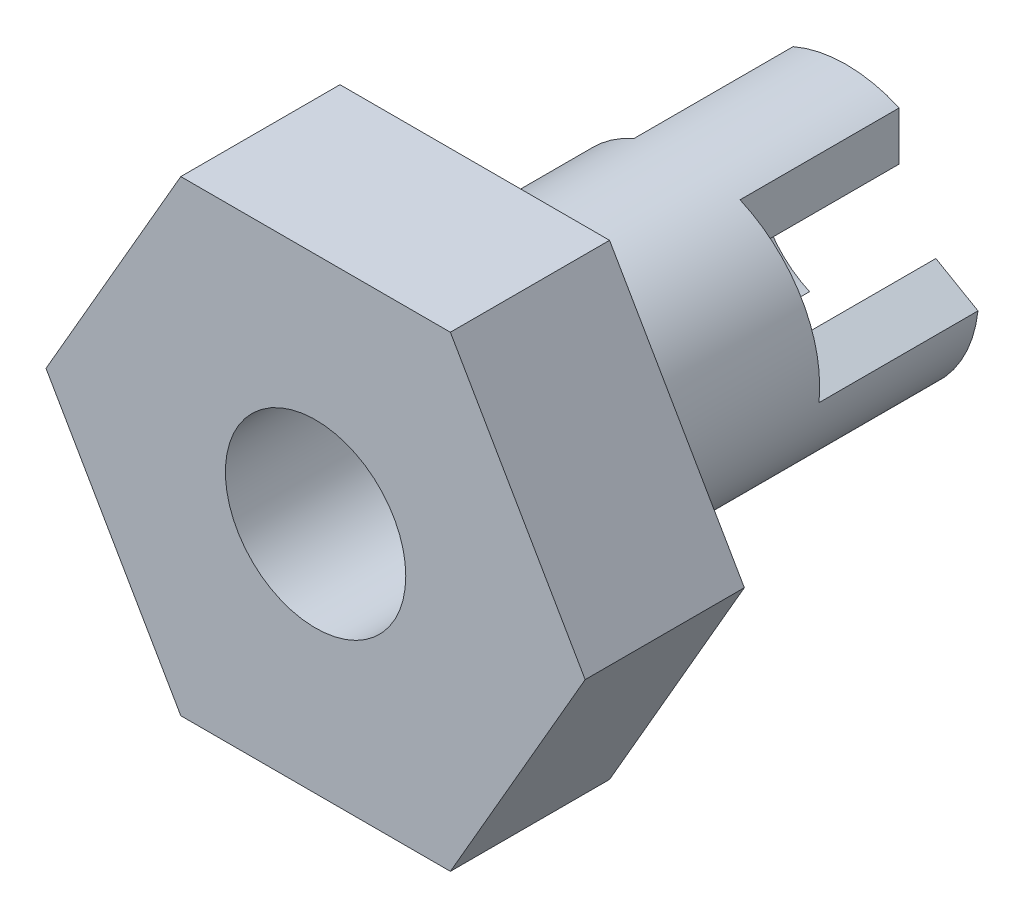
ISO-10303-21;
HEADER;
FILE_DESCRIPTION(('STEP AP214'),'2;1');
FILE_NAME('part.step','',(''),(''),'','','');
FILE_SCHEMA(('AUTOMOTIVE_DESIGN { 1 0 10303 214 1 1 1 1 }'));
ENDSEC;
DATA;
#1=APPLICATION_CONTEXT('core data for automotive mechanical design processes');
#2=APPLICATION_PROTOCOL_DEFINITION('international standard','automotive_design',2000,#1);
#3=PRODUCT_CONTEXT('',#1,'mechanical');
#4=PRODUCT('Part','Part','',(#3));
#5=PRODUCT_RELATED_PRODUCT_CATEGORY('part','',(#4));
#6=PRODUCT_DEFINITION_FORMATION('','',#4);
#7=PRODUCT_DEFINITION_CONTEXT('part definition',#1,'design');
#8=PRODUCT_DEFINITION('design','',#6,#7);
#9=PRODUCT_DEFINITION_SHAPE('','',#8);
#10=(LENGTH_UNIT() NAMED_UNIT(*) SI_UNIT(.MILLI.,.METRE.));
#11=(NAMED_UNIT(*) PLANE_ANGLE_UNIT() SI_UNIT($,.RADIAN.));
#12=(NAMED_UNIT(*) SI_UNIT($,.STERADIAN.) SOLID_ANGLE_UNIT());
#13=UNCERTAINTY_MEASURE_WITH_UNIT(LENGTH_MEASURE(1.E-05),#10,'distance_accuracy_value','');
#14=(GEOMETRIC_REPRESENTATION_CONTEXT(3) GLOBAL_UNCERTAINTY_ASSIGNED_CONTEXT((#13)) GLOBAL_UNIT_ASSIGNED_CONTEXT((#10,
#11,#12)) REPRESENTATION_CONTEXT('',''));
#15=CARTESIAN_POINT('',(0.,0.,0.));
#16=DIRECTION('',(0.,0.,1.));
#17=DIRECTION('',(1.,0.,0.));
#18=AXIS2_PLACEMENT_3D('',#15,#16,#17);
#19=CARTESIAN_POINT('',(0.,0.,-5.08));
#20=DIRECTION('',(0.,0.,-1.));
#21=DIRECTION('',(-1.,0.,0.));
#22=AXIS2_PLACEMENT_3D('',#19,#20,#21);
#23=PLANE('',#22);
#24=CARTESIAN_POINT('',(0.,0.,-5.08));
#25=DIRECTION('',(0.,0.,-1.));
#26=DIRECTION('',(-1.,0.,0.));
#27=AXIS2_PLACEMENT_3D('',#24,#25,#26);
#28=CIRCLE('',#27,3.175);
#29=CARTESIAN_POINT('',(1.27,2.90993556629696,-5.08));
#30=VERTEX_POINT('',#29);
#31=CARTESIAN_POINT('',(3.15507812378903,-0.355115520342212,-5.08));
#32=VERTEX_POINT('',#31);
#33=EDGE_CURVE('E250',#30,#32,#28,.T.);
#34=ORIENTED_EDGE('',*,*,#33,.T.);
#35=DIRECTION('',(0.86602540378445,-0.499999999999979,0.));
#36=VECTOR('',#35,1.);
#37=CARTESIAN_POINT('',(3.15507812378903,-0.355115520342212,-5.08));
#38=LINE('',#37,#36);
#39=CARTESIAN_POINT('',(2.14704687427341,0.226871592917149,-5.08));
#40=VERTEX_POINT('',#39);
#41=EDGE_CURVE('E58',#40,#32,#38,.T.);
#42=ORIENTED_EDGE('',*,*,#41,.F.);
#43=CARTESIAN_POINT('',(0.,0.,-5.08));
#44=DIRECTION('',(0.,0.,-1.));
#45=DIRECTION('',(-1.,0.,0.));
#46=AXIS2_PLACEMENT_3D('',#43,#44,#45);
#47=CIRCLE('',#46,2.159);
#48=CARTESIAN_POINT('',(1.27,1.74596133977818,-5.08));
#49=VERTEX_POINT('',#48);
#50=EDGE_CURVE('E185',#49,#40,#47,.T.);
#51=ORIENTED_EDGE('',*,*,#50,.F.);
#52=DIRECTION('',(0.,-1.,0.));
#53=VECTOR('',#52,1.);
#54=CARTESIAN_POINT('',(1.27,2.90993556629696,-5.08));
#55=LINE('',#54,#53);
#56=EDGE_CURVE('E189',#30,#49,#55,.T.);
#57=ORIENTED_EDGE('',*,*,#56,.F.);
#58=EDGE_LOOP('',(#34,#42,#51,#57));
#59=FACE_BOUND('',#58,.T.);
#60=ADVANCED_FACE('F35',(#59),#23,.T.);
#61=CARTESIAN_POINT('',(0.877046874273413,-1.97283293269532,-5.08));
#62=VERTEX_POINT('',#61);
#63=CARTESIAN_POINT('',(-0.877046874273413,-1.97283293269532,-5.08));
#64=VERTEX_POINT('',#63);
#65=EDGE_CURVE('E50',#62,#64,#47,.T.);
#66=ORIENTED_EDGE('',*,*,#65,.F.);
#67=DIRECTION('',(-0.866025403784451,0.499999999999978,0.));
#68=VECTOR('',#67,1.);
#69=CARTESIAN_POINT('',(1.88507812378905,-2.5548200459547,-5.08));
#70=LINE('',#69,#68);
#71=CARTESIAN_POINT('',(1.88507812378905,-2.5548200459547,-5.08));
#72=VERTEX_POINT('',#71);
#73=EDGE_CURVE('E180',#72,#62,#70,.T.);
#74=ORIENTED_EDGE('',*,*,#73,.F.);
#75=CARTESIAN_POINT('',(-1.88507812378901,-2.55482004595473,-5.08));
#76=VERTEX_POINT('',#75);
#77=EDGE_CURVE('E246',#72,#76,#28,.T.);
#78=ORIENTED_EDGE('',*,*,#77,.T.);
#79=DIRECTION('',(-0.866025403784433,-0.50000000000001,0.));
#80=VECTOR('',#79,1.);
#81=CARTESIAN_POINT('',(-1.88507812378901,-2.55482004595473,-5.08));
#82=LINE('',#81,#80);
#83=EDGE_CURVE('E217',#64,#76,#82,.T.);
#84=ORIENTED_EDGE('',*,*,#83,.F.);
#85=EDGE_LOOP('',(#66,#74,#78,#84));
#86=FACE_BOUND('',#85,.T.);
#87=ADVANCED_FACE('F335',(#86),#23,.T.);
#88=CARTESIAN_POINT('',(-3.15507812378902,-0.355115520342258,-5.08));
#89=VERTEX_POINT('',#88);
#90=CARTESIAN_POINT('',(-1.27,2.90993556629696,-5.08));
#91=VERTEX_POINT('',#90);
#92=EDGE_CURVE('E247',#89,#91,#28,.T.);
#93=ORIENTED_EDGE('',*,*,#92,.T.);
#94=DIRECTION('',(0.,1.,0.));
#95=VECTOR('',#94,1.);
#96=CARTESIAN_POINT('',(-1.27,2.90993556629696,-5.08));
#97=LINE('',#96,#95);
#98=CARTESIAN_POINT('',(-1.27,1.74596133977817,-5.08));
#99=VERTEX_POINT('',#98);
#100=EDGE_CURVE('E186',#99,#91,#97,.T.);
#101=ORIENTED_EDGE('',*,*,#100,.F.);
#102=CARTESIAN_POINT('',(-2.14704687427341,0.22687159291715,-5.08));
#103=VERTEX_POINT('',#102);
#104=EDGE_CURVE('E244',#103,#99,#47,.T.);
#105=ORIENTED_EDGE('',*,*,#104,.F.);
#106=DIRECTION('',(0.866025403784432,0.500000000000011,0.));
#107=VECTOR('',#106,1.);
#108=CARTESIAN_POINT('',(-3.15507812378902,-0.355115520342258,-5.08));
#109=LINE('',#108,#107);
#110=EDGE_CURVE('E222',#89,#103,#109,.T.);
#111=ORIENTED_EDGE('',*,*,#110,.F.);
#112=EDGE_LOOP('',(#93,#101,#105,#111));
#113=FACE_BOUND('',#112,.T.);
#114=ADVANCED_FACE('F337',(#113),#23,.T.);
#115=CARTESIAN_POINT('',(0.,0.,0.));
#116=DIRECTION('',(0.,0.,1.));
#117=DIRECTION('',(1.,0.,0.));
#118=AXIS2_PLACEMENT_3D('',#115,#116,#117);
#119=PLANE('',#118);
#120=DIRECTION('',(0.499999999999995,0.866025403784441,0.));
#121=VECTOR('',#120,1.);
#122=CARTESIAN_POINT('',(3.2262333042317,-5.58799999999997,0.));
#123=LINE('',#122,#121);
#124=CARTESIAN_POINT('',(3.2262333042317,-5.58799999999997,0.));
#125=VERTEX_POINT('',#124);
#126=CARTESIAN_POINT('',(6.45246660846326,0.,0.));
#127=VERTEX_POINT('',#126);
#128=EDGE_CURVE('E253',#125,#127,#123,.T.);
#129=ORIENTED_EDGE('',*,*,#128,.F.);
#130=DIRECTION('',(1.,0.,0.));
#131=VECTOR('',#130,1.);
#132=CARTESIAN_POINT('',(-3.22623330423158,-5.58800000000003,0.));
#133=LINE('',#132,#131);
#134=CARTESIAN_POINT('',(-3.22623330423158,-5.58800000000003,0.));
#135=VERTEX_POINT('',#134);
#136=EDGE_CURVE('E258',#135,#125,#133,.T.);
#137=ORIENTED_EDGE('',*,*,#136,.F.);
#138=DIRECTION('',(0.500000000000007,-0.866025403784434,0.));
#139=VECTOR('',#138,1.);
#140=CARTESIAN_POINT('',(-6.45246660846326,0.,0.));
#141=LINE('',#140,#139);
#142=CARTESIAN_POINT('',(-6.45246660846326,0.,0.));
#143=VERTEX_POINT('',#142);
#144=EDGE_CURVE('E277',#143,#135,#141,.T.);
#145=ORIENTED_EDGE('',*,*,#144,.F.);
#146=DIRECTION('',(-0.499999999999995,-0.866025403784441,0.));
#147=VECTOR('',#146,1.);
#148=CARTESIAN_POINT('',(-3.22623330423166,5.58799999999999,0.));
#149=LINE('',#148,#147);
#150=CARTESIAN_POINT('',(-3.22623330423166,5.58799999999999,0.));
#151=VERTEX_POINT('',#150);
#152=EDGE_CURVE('E275',#151,#143,#149,.T.);
#153=ORIENTED_EDGE('',*,*,#152,.F.);
#154=DIRECTION('',(-1.,0.,0.));
#155=VECTOR('',#154,1.);
#156=CARTESIAN_POINT('',(3.22623330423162,5.58800000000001,0.));
#157=LINE('',#156,#155);
#158=CARTESIAN_POINT('',(3.22623330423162,5.58800000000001,0.));
#159=VERTEX_POINT('',#158);
#160=EDGE_CURVE('E273',#159,#151,#157,.T.);
#161=ORIENTED_EDGE('',*,*,#160,.F.);
#162=DIRECTION('',(-0.500000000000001,0.866025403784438,0.));
#163=VECTOR('',#162,1.);
#164=CARTESIAN_POINT('',(6.45246660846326,0.,0.));
#165=LINE('',#164,#163);
#166=EDGE_CURVE('E271',#127,#159,#165,.T.);
#167=ORIENTED_EDGE('',*,*,#166,.F.);
#168=EDGE_LOOP('',(#129,#137,#145,#153,#161,#167));
#169=FACE_BOUND('',#168,.T.);
#170=CARTESIAN_POINT('',(0.,0.,0.));
#171=DIRECTION('',(0.,0.,1.));
#172=DIRECTION('',(1.,0.,0.));
#173=AXIS2_PLACEMENT_3D('',#170,#171,#172);
#174=CIRCLE('',#173,3.175);
#175=CARTESIAN_POINT('',(3.175,0.,0.));
#176=VERTEX_POINT('',#175);
#177=EDGE_CURVE('E11',#176,#176,#174,.F.);
#178=ORIENTED_EDGE('',*,*,#177,.F.);
#179=EDGE_LOOP('',(#178));
#180=FACE_BOUND('',#179,.T.);
#181=ADVANCED_FACE('F304',(#169,#180),#119,.F.);
#182=CARTESIAN_POINT('',(3.2262333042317,-5.58799999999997,3.81));
#183=DIRECTION('',(-0.866025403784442,0.499999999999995,0.));
#184=DIRECTION('',(-0.499999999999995,-0.866025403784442,0.));
#185=AXIS2_PLACEMENT_3D('',#182,#183,#184);
#186=PLANE('',#185);
#187=ORIENTED_EDGE('',*,*,#128,.T.);
#188=DIRECTION('',(0.,0.,-1.));
#189=VECTOR('',#188,1.);
#190=CARTESIAN_POINT('',(6.45246660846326,0.,3.81));
#191=LINE('',#190,#189);
#192=CARTESIAN_POINT('',(6.45246660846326,0.,3.81));
#193=VERTEX_POINT('',#192);
#194=EDGE_CURVE('E43',#193,#127,#191,.T.);
#195=ORIENTED_EDGE('',*,*,#194,.F.);
#196=DIRECTION('',(0.499999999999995,0.866025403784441,0.));
#197=VECTOR('',#196,1.);
#198=CARTESIAN_POINT('',(3.2262333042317,-5.58799999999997,3.81));
#199=LINE('',#198,#197);
#200=CARTESIAN_POINT('',(3.2262333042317,-5.58799999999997,3.81));
#201=VERTEX_POINT('',#200);
#202=EDGE_CURVE('E254',#201,#193,#199,.T.);
#203=ORIENTED_EDGE('',*,*,#202,.F.);
#204=DIRECTION('',(0.,0.,-1.));
#205=VECTOR('',#204,1.);
#206=CARTESIAN_POINT('',(3.2262333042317,-5.58799999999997,3.81));
#207=LINE('',#206,#205);
#208=EDGE_CURVE('E268',#201,#125,#207,.T.);
#209=ORIENTED_EDGE('',*,*,#208,.T.);
#210=EDGE_LOOP('',(#187,#195,#203,#209));
#211=FACE_BOUND('',#210,.T.);
#212=ADVANCED_FACE('F37',(#211),#186,.F.);
#213=CARTESIAN_POINT('',(6.45246660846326,0.,3.81));
#214=DIRECTION('',(-0.866025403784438,-0.500000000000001,0.));
#215=DIRECTION('',(0.500000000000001,-0.866025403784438,0.));
#216=AXIS2_PLACEMENT_3D('',#213,#214,#215);
#217=PLANE('',#216);
#218=ORIENTED_EDGE('',*,*,#166,.T.);
#219=DIRECTION('',(0.,0.,-1.));
#220=VECTOR('',#219,1.);
#221=CARTESIAN_POINT('',(3.22623330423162,5.58800000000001,3.81));
#222=LINE('',#221,#220);
#223=CARTESIAN_POINT('',(3.22623330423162,5.58800000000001,3.81));
#224=VERTEX_POINT('',#223);
#225=EDGE_CURVE('E291',#224,#159,#222,.T.);
#226=ORIENTED_EDGE('',*,*,#225,.F.);
#227=DIRECTION('',(-0.500000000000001,0.866025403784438,0.));
#228=VECTOR('',#227,1.);
#229=CARTESIAN_POINT('',(6.45246660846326,0.,3.81));
#230=LINE('',#229,#228);
#231=EDGE_CURVE('E257',#193,#224,#230,.T.);
#232=ORIENTED_EDGE('',*,*,#231,.F.);
#233=ORIENTED_EDGE('',*,*,#194,.T.);
#234=EDGE_LOOP('',(#218,#226,#232,#233));
#235=FACE_BOUND('',#234,.T.);
#236=ADVANCED_FACE('F296',(#235),#217,.F.);
#237=CARTESIAN_POINT('',(3.22623330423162,5.58800000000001,3.81));
#238=DIRECTION('',(0.,-1.,0.));
#239=DIRECTION('',(1.,0.,0.));
#240=AXIS2_PLACEMENT_3D('',#237,#238,#239);
#241=PLANE('',#240);
#242=ORIENTED_EDGE('',*,*,#160,.T.);
#243=DIRECTION('',(0.,0.,-1.));
#244=VECTOR('',#243,1.);
#245=CARTESIAN_POINT('',(-3.22623330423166,5.58799999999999,3.81));
#246=LINE('',#245,#244);
#247=CARTESIAN_POINT('',(-3.22623330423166,5.58799999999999,3.81));
#248=VERTEX_POINT('',#247);
#249=EDGE_CURVE('E288',#248,#151,#246,.T.);
#250=ORIENTED_EDGE('',*,*,#249,.F.);
#251=DIRECTION('',(-1.,0.,0.));
#252=VECTOR('',#251,1.);
#253=CARTESIAN_POINT('',(3.22623330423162,5.58800000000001,3.81));
#254=LINE('',#253,#252);
#255=EDGE_CURVE('E260',#224,#248,#254,.T.);
#256=ORIENTED_EDGE('',*,*,#255,.F.);
#257=ORIENTED_EDGE('',*,*,#225,.T.);
#258=EDGE_LOOP('',(#242,#250,#256,#257));
#259=FACE_BOUND('',#258,.T.);
#260=ADVANCED_FACE('F311',(#259),#241,.F.);
#261=CARTESIAN_POINT('',(-3.22623330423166,5.58799999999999,3.81));
#262=DIRECTION('',(0.866025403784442,-0.499999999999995,0.));
#263=DIRECTION('',(0.499999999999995,0.866025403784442,0.));
#264=AXIS2_PLACEMENT_3D('',#261,#262,#263);
#265=PLANE('',#264);
#266=ORIENTED_EDGE('',*,*,#152,.T.);
#267=DIRECTION('',(0.,0.,-1.));
#268=VECTOR('',#267,1.);
#269=CARTESIAN_POINT('',(-6.45246660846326,0.,3.81));
#270=LINE('',#269,#268);
#271=CARTESIAN_POINT('',(-6.45246660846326,0.,3.81));
#272=VERTEX_POINT('',#271);
#273=EDGE_CURVE('E285',#272,#143,#270,.T.);
#274=ORIENTED_EDGE('',*,*,#273,.F.);
#275=DIRECTION('',(-0.499999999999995,-0.866025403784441,0.));
#276=VECTOR('',#275,1.);
#277=CARTESIAN_POINT('',(-3.22623330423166,5.58799999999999,3.81));
#278=LINE('',#277,#276);
#279=EDGE_CURVE('E262',#248,#272,#278,.T.);
#280=ORIENTED_EDGE('',*,*,#279,.F.);
#281=ORIENTED_EDGE('',*,*,#249,.T.);
#282=EDGE_LOOP('',(#266,#274,#280,#281));
#283=FACE_BOUND('',#282,.T.);
#284=ADVANCED_FACE('F315',(#283),#265,.F.);
#285=CARTESIAN_POINT('',(-6.45246660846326,0.,3.81));
#286=DIRECTION('',(0.866025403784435,0.500000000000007,0.));
#287=DIRECTION('',(-0.500000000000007,0.866025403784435,0.));
#288=AXIS2_PLACEMENT_3D('',#285,#286,#287);
#289=PLANE('',#288);
#290=ORIENTED_EDGE('',*,*,#144,.T.);
#291=DIRECTION('',(0.,0.,-1.));
#292=VECTOR('',#291,1.);
#293=CARTESIAN_POINT('',(-3.22623330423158,-5.58800000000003,3.81));
#294=LINE('',#293,#292);
#295=CARTESIAN_POINT('',(-3.22623330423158,-5.58800000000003,3.81));
#296=VERTEX_POINT('',#295);
#297=EDGE_CURVE('E282',#296,#135,#294,.T.);
#298=ORIENTED_EDGE('',*,*,#297,.F.);
#299=DIRECTION('',(0.500000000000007,-0.866025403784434,0.));
#300=VECTOR('',#299,1.);
#301=CARTESIAN_POINT('',(-6.45246660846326,0.,3.81));
#302=LINE('',#301,#300);
#303=EDGE_CURVE('E264',#272,#296,#302,.T.);
#304=ORIENTED_EDGE('',*,*,#303,.F.);
#305=ORIENTED_EDGE('',*,*,#273,.T.);
#306=EDGE_LOOP('',(#290,#298,#304,#305));
#307=FACE_BOUND('',#306,.T.);
#308=ADVANCED_FACE('F325',(#307),#289,.F.);
#309=CARTESIAN_POINT('',(-3.22623330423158,-5.58800000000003,3.81));
#310=DIRECTION('',(0.,1.,0.));
#311=DIRECTION('',(-1.,0.,0.));
#312=AXIS2_PLACEMENT_3D('',#309,#310,#311);
#313=PLANE('',#312);
#314=ORIENTED_EDGE('',*,*,#136,.T.);
#315=ORIENTED_EDGE('',*,*,#208,.F.);
#316=DIRECTION('',(1.,0.,0.));
#317=VECTOR('',#316,1.);
#318=CARTESIAN_POINT('',(-3.22623330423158,-5.58800000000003,3.81));
#319=LINE('',#318,#317);
#320=EDGE_CURVE('E266',#296,#201,#319,.T.);
#321=ORIENTED_EDGE('',*,*,#320,.F.);
#322=ORIENTED_EDGE('',*,*,#297,.T.);
#323=EDGE_LOOP('',(#314,#315,#321,#322));
#324=FACE_BOUND('',#323,.T.);
#325=ADVANCED_FACE('F323',(#324),#313,.F.);
#326=CARTESIAN_POINT('',(0.,0.,3.81));
#327=DIRECTION('',(0.,0.,1.));
#328=DIRECTION('',(1.,0.,0.));
#329=AXIS2_PLACEMENT_3D('',#326,#327,#328);
#330=PLANE('',#329);
#331=CARTESIAN_POINT('',(0.,0.,3.81));
#332=DIRECTION('',(0.,0.,1.));
#333=DIRECTION('',(1.,0.,0.));
#334=AXIS2_PLACEMENT_3D('',#331,#332,#333);
#335=CIRCLE('',#334,2.159);
#336=CARTESIAN_POINT('',(2.159,0.,3.81));
#337=VERTEX_POINT('',#336);
#338=EDGE_CURVE('E249',#337,#337,#335,.T.);
#339=ORIENTED_EDGE('',*,*,#338,.F.);
#340=EDGE_LOOP('',(#339));
#341=FACE_BOUND('',#340,.T.);
#342=ORIENTED_EDGE('',*,*,#202,.T.);
#343=ORIENTED_EDGE('',*,*,#231,.T.);
#344=ORIENTED_EDGE('',*,*,#255,.T.);
#345=ORIENTED_EDGE('',*,*,#279,.T.);
#346=ORIENTED_EDGE('',*,*,#303,.T.);
#347=ORIENTED_EDGE('',*,*,#320,.T.);
#348=EDGE_LOOP('',(#342,#343,#344,#345,#346,#347));
#349=FACE_BOUND('',#348,.T.);
#350=ADVANCED_FACE('F319',(#341,#349),#330,.T.);
#351=CARTESIAN_POINT('',(0.,0.,0.));
#352=DIRECTION('',(0.,0.,1.));
#353=DIRECTION('',(1.,0.,0.));
#354=AXIS2_PLACEMENT_3D('',#351,#352,#353);
#355=CYLINDRICAL_SURFACE('',#354,2.159);
#356=ORIENTED_EDGE('',*,*,#338,.T.);
#357=EDGE_LOOP('',(#356));
#358=FACE_BOUND('',#357,.T.);
#359=ORIENTED_EDGE('',*,*,#104,.T.);
#360=DIRECTION('',(0.,0.,1.));
#361=VECTOR('',#360,1.);
#362=CARTESIAN_POINT('',(-1.27,1.74596133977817,-8.89));
#363=LINE('',#362,#361);
#364=CARTESIAN_POINT('',(-1.27,1.74596133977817,-8.89));
#365=VERTEX_POINT('',#364);
#366=EDGE_CURVE('E214',#365,#99,#363,.T.);
#367=ORIENTED_EDGE('',*,*,#366,.F.);
#368=CARTESIAN_POINT('',(0.,0.,-8.89));
#369=DIRECTION('',(0.,0.,1.));
#370=DIRECTION('',(-1.,0.,0.));
#371=AXIS2_PLACEMENT_3D('',#368,#369,#370);
#372=CIRCLE('',#371,2.159);
#373=CARTESIAN_POINT('',(1.27,1.74596133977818,-8.89));
#374=VERTEX_POINT('',#373);
#375=EDGE_CURVE('E195',#374,#365,#372,.T.);
#376=ORIENTED_EDGE('',*,*,#375,.F.);
#377=DIRECTION('',(0.,0.,1.));
#378=VECTOR('',#377,1.);
#379=CARTESIAN_POINT('',(1.27,1.74596133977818,-8.89));
#380=LINE('',#379,#378);
#381=EDGE_CURVE('E203',#374,#49,#380,.T.);
#382=ORIENTED_EDGE('',*,*,#381,.T.);
#383=ORIENTED_EDGE('',*,*,#50,.T.);
#384=DIRECTION('',(0.,0.,1.));
#385=VECTOR('',#384,1.);
#386=CARTESIAN_POINT('',(2.14704687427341,0.226871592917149,-8.89));
#387=LINE('',#386,#385);
#388=CARTESIAN_POINT('',(2.14704687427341,0.226871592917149,-8.89));
#389=VERTEX_POINT('',#388);
#390=EDGE_CURVE('E165',#389,#40,#387,.T.);
#391=ORIENTED_EDGE('',*,*,#390,.F.);
#392=CARTESIAN_POINT('',(0.,0.,-8.89));
#393=DIRECTION('',(0.,0.,1.));
#394=DIRECTION('',(-1.,0.,0.));
#395=AXIS2_PLACEMENT_3D('',#392,#393,#394);
#396=CIRCLE('',#395,2.159);
#397=CARTESIAN_POINT('',(0.877046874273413,-1.97283293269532,-8.89));
#398=VERTEX_POINT('',#397);
#399=EDGE_CURVE('E171',#398,#389,#396,.T.);
#400=ORIENTED_EDGE('',*,*,#399,.F.);
#401=DIRECTION('',(0.,0.,1.));
#402=VECTOR('',#401,1.);
#403=CARTESIAN_POINT('',(0.877046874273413,-1.97283293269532,-8.89));
#404=LINE('',#403,#402);
#405=EDGE_CURVE('E382',#398,#62,#404,.T.);
#406=ORIENTED_EDGE('',*,*,#405,.T.);
#407=ORIENTED_EDGE('',*,*,#65,.T.);
#408=DIRECTION('',(0.,0.,1.));
#409=VECTOR('',#408,1.);
#410=CARTESIAN_POINT('',(-0.877046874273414,-1.97283293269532,-8.89));
#411=LINE('',#410,#409);
#412=CARTESIAN_POINT('',(-0.877046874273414,-1.97283293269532,-8.89));
#413=VERTEX_POINT('',#412);
#414=EDGE_CURVE('E241',#413,#64,#411,.T.);
#415=ORIENTED_EDGE('',*,*,#414,.F.);
#416=CARTESIAN_POINT('',(0.,0.,-8.89));
#417=DIRECTION('',(0.,0.,1.));
#418=DIRECTION('',(-1.,0.,0.));
#419=AXIS2_PLACEMENT_3D('',#416,#417,#418);
#420=CIRCLE('',#419,2.159);
#421=CARTESIAN_POINT('',(-2.14704687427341,0.22687159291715,-8.89));
#422=VERTEX_POINT('',#421);
#423=EDGE_CURVE('E218',#422,#413,#420,.T.);
#424=ORIENTED_EDGE('',*,*,#423,.F.);
#425=DIRECTION('',(0.,0.,1.));
#426=VECTOR('',#425,1.);
#427=CARTESIAN_POINT('',(-2.14704687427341,0.22687159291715,-8.89));
#428=LINE('',#427,#426);
#429=EDGE_CURVE('E228',#422,#103,#428,.T.);
#430=ORIENTED_EDGE('',*,*,#429,.T.);
#431=EDGE_LOOP('',(#359,#367,#376,#382,#383,#391,#400,#406,#407,#415,#424,#430));
#432=FACE_BOUND('',#431,.T.);
#433=ADVANCED_FACE('F183',(#358,#432),#355,.F.);
#434=CARTESIAN_POINT('',(0.,0.,-5.08));
#435=DIRECTION('',(0.,0.,1.));
#436=DIRECTION('',(1.,0.,0.));
#437=AXIS2_PLACEMENT_3D('',#434,#435,#436);
#438=CYLINDRICAL_SURFACE('',#437,3.175);
#439=ORIENTED_EDGE('',*,*,#92,.F.);
#440=DIRECTION('',(0.,0.,1.));
#441=VECTOR('',#440,1.);
#442=CARTESIAN_POINT('',(-3.15507812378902,-0.355115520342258,-8.89));
#443=LINE('',#442,#441);
#444=CARTESIAN_POINT('',(-3.15507812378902,-0.355115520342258,-8.89));
#445=VERTEX_POINT('',#444);
#446=EDGE_CURVE('E235',#445,#89,#443,.T.);
#447=ORIENTED_EDGE('',*,*,#446,.F.);
#448=CARTESIAN_POINT('',(0.,0.,-8.89));
#449=DIRECTION('',(0.,0.,-1.));
#450=DIRECTION('',(-1.,0.,0.));
#451=AXIS2_PLACEMENT_3D('',#448,#449,#450);
#452=CIRCLE('',#451,3.175);
#453=CARTESIAN_POINT('',(-1.88507812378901,-2.55482004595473,-8.89));
#454=VERTEX_POINT('',#453);
#455=EDGE_CURVE('E224',#454,#445,#452,.T.);
#456=ORIENTED_EDGE('',*,*,#455,.F.);
#457=DIRECTION('',(0.,0.,1.));
#458=VECTOR('',#457,1.);
#459=CARTESIAN_POINT('',(-1.88507812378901,-2.55482004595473,-8.89));
#460=LINE('',#459,#458);
#461=EDGE_CURVE('E238',#454,#76,#460,.T.);
#462=ORIENTED_EDGE('',*,*,#461,.T.);
#463=ORIENTED_EDGE('',*,*,#77,.F.);
#464=DIRECTION('',(0.,0.,1.));
#465=VECTOR('',#464,1.);
#466=CARTESIAN_POINT('',(1.88507812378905,-2.5548200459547,-8.89));
#467=LINE('',#466,#465);
#468=CARTESIAN_POINT('',(1.88507812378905,-2.5548200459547,-8.89));
#469=VERTEX_POINT('',#468);
#470=EDGE_CURVE('E191',#469,#72,#467,.T.);
#471=ORIENTED_EDGE('',*,*,#470,.F.);
#472=CARTESIAN_POINT('',(0.,0.,-8.89));
#473=DIRECTION('',(0.,0.,-1.));
#474=DIRECTION('',(-1.,0.,0.));
#475=AXIS2_PLACEMENT_3D('',#472,#473,#474);
#476=CIRCLE('',#475,3.175);
#477=CARTESIAN_POINT('',(3.15507812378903,-0.355115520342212,-8.89));
#478=VERTEX_POINT('',#477);
#479=EDGE_CURVE('E170',#478,#469,#476,.T.);
#480=ORIENTED_EDGE('',*,*,#479,.F.);
#481=DIRECTION('',(0.,0.,1.));
#482=VECTOR('',#481,1.);
#483=CARTESIAN_POINT('',(3.15507812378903,-0.355115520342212,-8.89));
#484=LINE('',#483,#482);
#485=EDGE_CURVE('E167',#478,#32,#484,.T.);
#486=ORIENTED_EDGE('',*,*,#485,.T.);
#487=ORIENTED_EDGE('',*,*,#33,.F.);
#488=DIRECTION('',(0.,0.,1.));
#489=VECTOR('',#488,1.);
#490=CARTESIAN_POINT('',(1.27,2.90993556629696,-8.89));
#491=LINE('',#490,#489);
#492=CARTESIAN_POINT('',(1.27,2.90993556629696,-8.89));
#493=VERTEX_POINT('',#492);
#494=EDGE_CURVE('E208',#493,#30,#491,.T.);
#495=ORIENTED_EDGE('',*,*,#494,.F.);
#496=CARTESIAN_POINT('',(0.,0.,-8.89));
#497=DIRECTION('',(0.,0.,-1.));
#498=DIRECTION('',(-1.,0.,0.));
#499=AXIS2_PLACEMENT_3D('',#496,#497,#498);
#500=CIRCLE('',#499,3.175);
#501=CARTESIAN_POINT('',(-1.27,2.90993556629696,-8.89));
#502=VERTEX_POINT('',#501);
#503=EDGE_CURVE('E200',#502,#493,#500,.T.);
#504=ORIENTED_EDGE('',*,*,#503,.F.);
#505=DIRECTION('',(0.,0.,1.));
#506=VECTOR('',#505,1.);
#507=CARTESIAN_POINT('',(-1.27,2.90993556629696,-8.89));
#508=LINE('',#507,#506);
#509=EDGE_CURVE('E211',#502,#91,#508,.T.);
#510=ORIENTED_EDGE('',*,*,#509,.T.);
#511=EDGE_LOOP('',(#439,#447,#456,#462,#463,#471,#480,#486,#487,#495,#504,#510));
#512=FACE_BOUND('',#511,.T.);
#513=ORIENTED_EDGE('',*,*,#177,.T.);
#514=EDGE_LOOP('',(#513));
#515=FACE_BOUND('',#514,.T.);
#516=ADVANCED_FACE('F357',(#512,#515),#438,.T.);
#517=CARTESIAN_POINT('',(-1.88507812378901,-2.55482004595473,-8.89));
#518=DIRECTION('',(-0.50000000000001,0.866025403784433,0.));
#519=DIRECTION('',(-0.866025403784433,-0.50000000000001,0.));
#520=AXIS2_PLACEMENT_3D('',#517,#518,#519);
#521=PLANE('',#520);
#522=ORIENTED_EDGE('',*,*,#83,.T.);
#523=ORIENTED_EDGE('',*,*,#461,.F.);
#524=DIRECTION('',(-0.866025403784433,-0.50000000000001,0.));
#525=VECTOR('',#524,1.);
#526=CARTESIAN_POINT('',(-1.88507812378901,-2.55482004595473,-8.89));
#527=LINE('',#526,#525);
#528=EDGE_CURVE('E221',#413,#454,#527,.T.);
#529=ORIENTED_EDGE('',*,*,#528,.F.);
#530=ORIENTED_EDGE('',*,*,#414,.T.);
#531=EDGE_LOOP('',(#522,#523,#529,#530));
#532=FACE_BOUND('',#531,.T.);
#533=ADVANCED_FACE('F376',(#532),#521,.F.);
#534=CARTESIAN_POINT('',(-3.15507812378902,-0.355115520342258,-8.89));
#535=DIRECTION('',(0.500000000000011,-0.866025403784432,0.));
#536=DIRECTION('',(0.866025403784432,0.500000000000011,0.));
#537=AXIS2_PLACEMENT_3D('',#534,#535,#536);
#538=PLANE('',#537);
#539=ORIENTED_EDGE('',*,*,#110,.T.);
#540=ORIENTED_EDGE('',*,*,#429,.F.);
#541=DIRECTION('',(0.866025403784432,0.500000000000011,0.));
#542=VECTOR('',#541,1.);
#543=CARTESIAN_POINT('',(-3.15507812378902,-0.355115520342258,-8.89));
#544=LINE('',#543,#542);
#545=EDGE_CURVE('E226',#445,#422,#544,.T.);
#546=ORIENTED_EDGE('',*,*,#545,.F.);
#547=ORIENTED_EDGE('',*,*,#446,.T.);
#548=EDGE_LOOP('',(#539,#540,#546,#547));
#549=FACE_BOUND('',#548,.T.);
#550=ADVANCED_FACE('F368',(#549),#538,.F.);
#551=CARTESIAN_POINT('',(0.,0.,-8.89));
#552=DIRECTION('',(0.,0.,-1.));
#553=DIRECTION('',(-1.,0.,0.));
#554=AXIS2_PLACEMENT_3D('',#551,#552,#553);
#555=PLANE('',#554);
#556=ORIENTED_EDGE('',*,*,#423,.T.);
#557=ORIENTED_EDGE('',*,*,#528,.T.);
#558=ORIENTED_EDGE('',*,*,#455,.T.);
#559=ORIENTED_EDGE('',*,*,#545,.T.);
#560=EDGE_LOOP('',(#556,#557,#558,#559));
#561=FACE_BOUND('',#560,.T.);
#562=ADVANCED_FACE('F373',(#561),#555,.T.);
#563=CARTESIAN_POINT('',(-1.27,2.90993556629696,-8.89));
#564=DIRECTION('',(1.,0.,0.));
#565=DIRECTION('',(0.,0.,-1.));
#566=AXIS2_PLACEMENT_3D('',#563,#564,#565);
#567=PLANE('',#566);
#568=ORIENTED_EDGE('',*,*,#100,.T.);
#569=ORIENTED_EDGE('',*,*,#509,.F.);
#570=DIRECTION('',(0.,1.,0.));
#571=VECTOR('',#570,1.);
#572=CARTESIAN_POINT('',(-1.27,2.90993556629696,-8.89));
#573=LINE('',#572,#571);
#574=EDGE_CURVE('E198',#365,#502,#573,.T.);
#575=ORIENTED_EDGE('',*,*,#574,.F.);
#576=ORIENTED_EDGE('',*,*,#366,.T.);
#577=EDGE_LOOP('',(#568,#569,#575,#576));
#578=FACE_BOUND('',#577,.T.);
#579=ADVANCED_FACE('F354',(#578),#567,.F.);
#580=CARTESIAN_POINT('',(1.27,2.90993556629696,-8.89));
#581=DIRECTION('',(-1.,0.,0.));
#582=DIRECTION('',(0.,-1.,0.));
#583=AXIS2_PLACEMENT_3D('',#580,#581,#582);
#584=PLANE('',#583);
#585=ORIENTED_EDGE('',*,*,#56,.T.);
#586=ORIENTED_EDGE('',*,*,#381,.F.);
#587=DIRECTION('',(0.,-1.,0.));
#588=VECTOR('',#587,1.);
#589=CARTESIAN_POINT('',(1.27,2.90993556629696,-8.89));
#590=LINE('',#589,#588);
#591=EDGE_CURVE('E202',#493,#374,#590,.T.);
#592=ORIENTED_EDGE('',*,*,#591,.F.);
#593=ORIENTED_EDGE('',*,*,#494,.T.);
#594=EDGE_LOOP('',(#585,#586,#592,#593));
#595=FACE_BOUND('',#594,.T.);
#596=ADVANCED_FACE('F399',(#595),#584,.F.);
#597=CARTESIAN_POINT('',(0.,0.,-8.89));
#598=DIRECTION('',(0.,0.,-1.));
#599=DIRECTION('',(-1.,0.,0.));
#600=AXIS2_PLACEMENT_3D('',#597,#598,#599);
#601=PLANE('',#600);
#602=ORIENTED_EDGE('',*,*,#375,.T.);
#603=ORIENTED_EDGE('',*,*,#574,.T.);
#604=ORIENTED_EDGE('',*,*,#503,.T.);
#605=ORIENTED_EDGE('',*,*,#591,.T.);
#606=EDGE_LOOP('',(#602,#603,#604,#605));
#607=FACE_BOUND('',#606,.T.);
#608=ADVANCED_FACE('F362',(#607),#601,.T.);
#609=CARTESIAN_POINT('',(3.15507812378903,-0.355115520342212,-8.89));
#610=DIRECTION('',(-0.499999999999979,-0.86602540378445,0.));
#611=DIRECTION('',(0.866025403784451,-0.49999999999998,0.));
#612=AXIS2_PLACEMENT_3D('',#609,#610,#611);
#613=PLANE('',#612);
#614=ORIENTED_EDGE('',*,*,#41,.T.);
#615=ORIENTED_EDGE('',*,*,#485,.F.);
#616=DIRECTION('',(0.86602540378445,-0.499999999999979,0.));
#617=VECTOR('',#616,1.);
#618=CARTESIAN_POINT('',(3.15507812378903,-0.355115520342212,-8.89));
#619=LINE('',#618,#617);
#620=EDGE_CURVE('E161',#389,#478,#619,.T.);
#621=ORIENTED_EDGE('',*,*,#620,.F.);
#622=ORIENTED_EDGE('',*,*,#390,.T.);
#623=EDGE_LOOP('',(#614,#615,#621,#622));
#624=FACE_BOUND('',#623,.T.);
#625=ADVANCED_FACE('F163',(#624),#613,.F.);
#626=CARTESIAN_POINT('',(1.88507812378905,-2.5548200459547,-8.89));
#627=DIRECTION('',(0.499999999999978,0.866025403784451,0.));
#628=DIRECTION('',(-0.866025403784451,0.499999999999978,0.));
#629=AXIS2_PLACEMENT_3D('',#626,#627,#628);
#630=PLANE('',#629);
#631=ORIENTED_EDGE('',*,*,#73,.T.);
#632=ORIENTED_EDGE('',*,*,#405,.F.);
#633=DIRECTION('',(-0.866025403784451,0.499999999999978,0.));
#634=VECTOR('',#633,1.);
#635=CARTESIAN_POINT('',(1.88507812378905,-2.5548200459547,-8.89));
#636=LINE('',#635,#634);
#637=EDGE_CURVE('E176',#469,#398,#636,.T.);
#638=ORIENTED_EDGE('',*,*,#637,.F.);
#639=ORIENTED_EDGE('',*,*,#470,.T.);
#640=EDGE_LOOP('',(#631,#632,#638,#639));
#641=FACE_BOUND('',#640,.T.);
#642=ADVANCED_FACE('F387',(#641),#630,.F.);
#643=CARTESIAN_POINT('',(0.,0.,-8.89));
#644=DIRECTION('',(0.,0.,-1.));
#645=DIRECTION('',(-1.,0.,0.));
#646=AXIS2_PLACEMENT_3D('',#643,#644,#645);
#647=PLANE('',#646);
#648=ORIENTED_EDGE('',*,*,#399,.T.);
#649=ORIENTED_EDGE('',*,*,#620,.T.);
#650=ORIENTED_EDGE('',*,*,#479,.T.);
#651=ORIENTED_EDGE('',*,*,#637,.T.);
#652=EDGE_LOOP('',(#648,#649,#650,#651));
#653=FACE_BOUND('',#652,.T.);
#654=ADVANCED_FACE('F174',(#653),#647,.T.);
#655=CLOSED_SHELL('',(#60,#87,#114,#181,#212,#236,#260,#284,#308,#325,#350,#433,#516,#533,#550,
#562,#579,#596,#608,#625,#642,#654));
#656=MANIFOLD_SOLID_BREP('B2',#655);
#657=ADVANCED_BREP_SHAPE_REPRESENTATION('',(#18,#656),#14);
#658=SHAPE_DEFINITION_REPRESENTATION(#9,#657);
ENDSEC;
END-ISO-10303-21;
